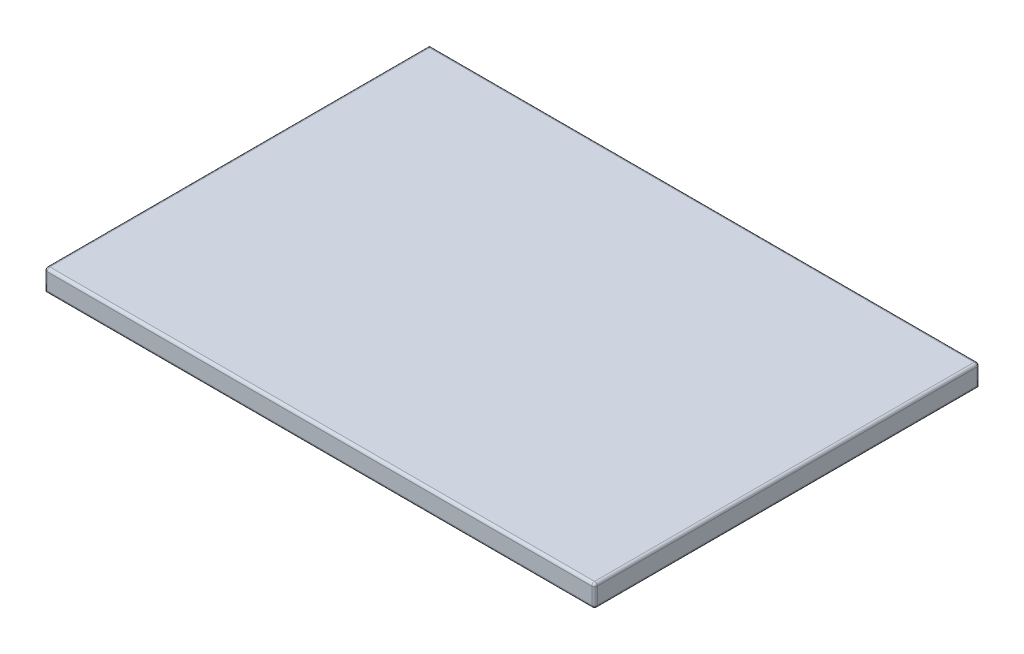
ISO-10303-21;
HEADER;
FILE_DESCRIPTION(('STEP AP214'),'2;1');
FILE_NAME('part.step','',(''),(''),'','','');
FILE_SCHEMA(('AUTOMOTIVE_DESIGN { 1 0 10303 214 1 1 1 1 }'));
ENDSEC;
DATA;
#1=APPLICATION_CONTEXT('core data for automotive mechanical design processes');
#2=APPLICATION_PROTOCOL_DEFINITION('international standard','automotive_design',2000,#1);
#3=PRODUCT_CONTEXT('',#1,'mechanical');
#4=PRODUCT('Part','Part','',(#3));
#5=PRODUCT_RELATED_PRODUCT_CATEGORY('part','',(#4));
#6=PRODUCT_DEFINITION_FORMATION('','',#4);
#7=PRODUCT_DEFINITION_CONTEXT('part definition',#1,'design');
#8=PRODUCT_DEFINITION('design','',#6,#7);
#9=PRODUCT_DEFINITION_SHAPE('','',#8);
#10=(LENGTH_UNIT() NAMED_UNIT(*) SI_UNIT(.MILLI.,.METRE.));
#11=(NAMED_UNIT(*) PLANE_ANGLE_UNIT() SI_UNIT($,.RADIAN.));
#12=(NAMED_UNIT(*) SI_UNIT($,.STERADIAN.) SOLID_ANGLE_UNIT());
#13=UNCERTAINTY_MEASURE_WITH_UNIT(LENGTH_MEASURE(1.E-05),#10,'distance_accuracy_value','');
#14=(GEOMETRIC_REPRESENTATION_CONTEXT(3) GLOBAL_UNCERTAINTY_ASSIGNED_CONTEXT((#13)) GLOBAL_UNIT_ASSIGNED_CONTEXT((#10,
#11,#12)) REPRESENTATION_CONTEXT('',''));
#15=CARTESIAN_POINT('',(0.,0.,0.));
#16=DIRECTION('',(0.,0.,1.));
#17=DIRECTION('',(1.,0.,0.));
#18=AXIS2_PLACEMENT_3D('',#15,#16,#17);
#19=CARTESIAN_POINT('',(0.,4.,0.));
#20=DIRECTION('',(1.,0.,0.));
#21=DIRECTION('',(0.,0.,-1.));
#22=AXIS2_PLACEMENT_3D('',#19,#20,#21);
#23=PLANE('',#22);
#24=DIRECTION('',(0.,0.,1.));
#25=VECTOR('',#24,1.);
#26=CARTESIAN_POINT('',(0.,3.5,0.));
#27=LINE('',#26,#25);
#28=CARTESIAN_POINT('',(0.,3.5,63.519379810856));
#29=VERTEX_POINT('',#28);
#30=CARTESIAN_POINT('',(0.,3.5,61.3346122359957));
#31=VERTEX_POINT('',#30);
#32=EDGE_CURVE('E309',#29,#31,#27,.F.);
#33=ORIENTED_EDGE('',*,*,#32,.T.);
#34=DIRECTION('',(0.,1.,0.));
#35=VECTOR('',#34,1.);
#36=CARTESIAN_POINT('',(0.,3.5,61.3346122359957));
#37=LINE('',#36,#35);
#38=CARTESIAN_POINT('',(0.,0.,61.3346122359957));
#39=VERTEX_POINT('',#38);
#40=EDGE_CURVE('E58',#39,#31,#37,.T.);
#41=ORIENTED_EDGE('',*,*,#40,.F.);
#42=DIRECTION('',(0.,0.,1.));
#43=VECTOR('',#42,1.);
#44=CARTESIAN_POINT('',(0.,0.,0.));
#45=LINE('',#44,#43);
#46=CARTESIAN_POINT('',(0.,0.,63.519379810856));
#47=VERTEX_POINT('',#46);
#48=EDGE_CURVE('E265',#39,#47,#45,.T.);
#49=ORIENTED_EDGE('',*,*,#48,.T.);
#50=DIRECTION('',(0.,-1.,0.));
#51=VECTOR('',#50,1.);
#52=CARTESIAN_POINT('',(0.,3.5,63.519379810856));
#53=LINE('',#52,#51);
#54=EDGE_CURVE('E206',#29,#47,#53,.T.);
#55=ORIENTED_EDGE('',*,*,#54,.F.);
#56=EDGE_LOOP('',(#33,#41,#49,#55));
#57=FACE_BOUND('',#56,.T.);
#58=ADVANCED_FACE('F33',(#57),#23,.F.);
#59=CARTESIAN_POINT('',(0.,0.,53.3911727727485));
#60=VERTEX_POINT('',#59);
#61=CARTESIAN_POINT('',(0.,0.,56.2588028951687));
#62=VERTEX_POINT('',#61);
#63=EDGE_CURVE('E264',#60,#62,#45,.T.);
#64=ORIENTED_EDGE('',*,*,#63,.T.);
#65=DIRECTION('',(0.,-1.,0.));
#66=VECTOR('',#65,1.);
#67=CARTESIAN_POINT('',(0.,3.5,56.2588028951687));
#68=LINE('',#67,#66);
#69=CARTESIAN_POINT('',(0.,3.5,56.2588028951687));
#70=VERTEX_POINT('',#69);
#71=EDGE_CURVE('E194',#70,#62,#68,.T.);
#72=ORIENTED_EDGE('',*,*,#71,.F.);
#73=CARTESIAN_POINT('',(0.,3.5,53.3911727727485));
#74=VERTEX_POINT('',#73);
#75=EDGE_CURVE('E374',#70,#74,#27,.F.);
#76=ORIENTED_EDGE('',*,*,#75,.T.);
#77=DIRECTION('',(0.,1.,0.));
#78=VECTOR('',#77,1.);
#79=CARTESIAN_POINT('',(0.,3.5,53.3911727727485));
#80=LINE('',#79,#78);
#81=EDGE_CURVE('E50',#60,#74,#80,.T.);
#82=ORIENTED_EDGE('',*,*,#81,.F.);
#83=EDGE_LOOP('',(#64,#72,#76,#82));
#84=FACE_BOUND('',#83,.T.);
#85=ADVANCED_FACE('F359',(#84),#23,.F.);
#86=CARTESIAN_POINT('',(0.,0.,0.));
#87=VERTEX_POINT('',#86);
#88=CARTESIAN_POINT('',(0.,0.,49.0578469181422));
#89=VERTEX_POINT('',#88);
#90=EDGE_CURVE('E260',#87,#89,#45,.T.);
#91=ORIENTED_EDGE('',*,*,#90,.T.);
#92=DIRECTION('',(0.,-1.,0.));
#93=VECTOR('',#92,1.);
#94=CARTESIAN_POINT('',(0.,3.5,49.0578469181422));
#95=LINE('',#94,#93);
#96=CARTESIAN_POINT('',(0.,3.5,49.0578469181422));
#97=VERTEX_POINT('',#96);
#98=EDGE_CURVE('E215',#97,#89,#95,.T.);
#99=ORIENTED_EDGE('',*,*,#98,.F.);
#100=CARTESIAN_POINT('',(0.,3.5,0.));
#101=VERTEX_POINT('',#100);
#102=EDGE_CURVE('E305',#97,#101,#27,.F.);
#103=ORIENTED_EDGE('',*,*,#102,.T.);
#104=DIRECTION('',(0.,-1.,0.));
#105=VECTOR('',#104,1.);
#106=CARTESIAN_POINT('',(0.,4.,0.));
#107=LINE('',#106,#105);
#108=EDGE_CURVE('E268',#101,#87,#107,.T.);
#109=ORIENTED_EDGE('',*,*,#108,.T.);
#110=EDGE_LOOP('',(#91,#99,#103,#109));
#111=FACE_BOUND('',#110,.T.);
#112=ADVANCED_FACE('F379',(#111),#23,.F.);
#113=CARTESIAN_POINT('',(0.,4.,70.));
#114=DIRECTION('',(0.,0.,-1.));
#115=DIRECTION('',(-1.,0.,0.));
#116=AXIS2_PLACEMENT_3D('',#113,#114,#115);
#117=PLANE('',#116);
#118=DIRECTION('',(1.,0.,0.));
#119=VECTOR('',#118,1.);
#120=CARTESIAN_POINT('',(0.,0.5,70.));
#121=LINE('',#120,#119);
#122=CARTESIAN_POINT('',(0.500000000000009,0.5,70.));
#123=VERTEX_POINT('',#122);
#124=CARTESIAN_POINT('',(99.5,0.5,70.));
#125=VERTEX_POINT('',#124);
#126=EDGE_CURVE('E274',#123,#125,#121,.T.);
#127=ORIENTED_EDGE('',*,*,#126,.T.);
#128=DIRECTION('',(0.,-1.,0.));
#129=VECTOR('',#128,1.);
#130=CARTESIAN_POINT('',(99.5,4.,70.));
#131=LINE('',#130,#129);
#132=CARTESIAN_POINT('',(99.5,3.5,70.));
#133=VERTEX_POINT('',#132);
#134=EDGE_CURVE('E277',#125,#133,#131,.F.);
#135=ORIENTED_EDGE('',*,*,#134,.T.);
#136=DIRECTION('',(1.,0.,0.));
#137=VECTOR('',#136,1.);
#138=CARTESIAN_POINT('',(0.,3.5,70.));
#139=LINE('',#138,#137);
#140=CARTESIAN_POINT('',(0.500000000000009,3.5,70.));
#141=VERTEX_POINT('',#140);
#142=EDGE_CURVE('E272',#133,#141,#139,.F.);
#143=ORIENTED_EDGE('',*,*,#142,.T.);
#144=DIRECTION('',(0.,-1.,0.));
#145=VECTOR('',#144,1.);
#146=CARTESIAN_POINT('',(0.500000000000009,4.,70.));
#147=LINE('',#146,#145);
#148=EDGE_CURVE('E270',#141,#123,#147,.T.);
#149=ORIENTED_EDGE('',*,*,#148,.T.);
#150=EDGE_LOOP('',(#127,#135,#143,#149));
#151=FACE_BOUND('',#150,.T.);
#152=ADVANCED_FACE('F427',(#151),#117,.F.);
#153=CARTESIAN_POINT('',(100.,4.,0.));
#154=DIRECTION('',(-1.,0.,0.));
#155=DIRECTION('',(0.,0.,1.));
#156=AXIS2_PLACEMENT_3D('',#153,#154,#155);
#157=PLANE('',#156);
#158=DIRECTION('',(0.,0.,-1.));
#159=VECTOR('',#158,1.);
#160=CARTESIAN_POINT('',(100.,0.5,0.));
#161=LINE('',#160,#159);
#162=CARTESIAN_POINT('',(100.,0.5,69.5));
#163=VERTEX_POINT('',#162);
#164=CARTESIAN_POINT('',(100.,0.5,0.5));
#165=VERTEX_POINT('',#164);
#166=EDGE_CURVE('E288',#163,#165,#161,.T.);
#167=ORIENTED_EDGE('',*,*,#166,.T.);
#168=DIRECTION('',(0.,-1.,0.));
#169=VECTOR('',#168,1.);
#170=CARTESIAN_POINT('',(100.,4.,0.5));
#171=LINE('',#170,#169);
#172=CARTESIAN_POINT('',(100.,3.5,0.5));
#173=VERTEX_POINT('',#172);
#174=EDGE_CURVE('E291',#165,#173,#171,.F.);
#175=ORIENTED_EDGE('',*,*,#174,.T.);
#176=DIRECTION('',(0.,0.,-1.));
#177=VECTOR('',#176,1.);
#178=CARTESIAN_POINT('',(100.,3.5,70.));
#179=LINE('',#178,#177);
#180=CARTESIAN_POINT('',(100.,3.5,69.5));
#181=VERTEX_POINT('',#180);
#182=EDGE_CURVE('E286',#173,#181,#179,.F.);
#183=ORIENTED_EDGE('',*,*,#182,.T.);
#184=DIRECTION('',(0.,-1.,0.));
#185=VECTOR('',#184,1.);
#186=CARTESIAN_POINT('',(100.,4.,69.5));
#187=LINE('',#186,#185);
#188=EDGE_CURVE('E284',#181,#163,#187,.T.);
#189=ORIENTED_EDGE('',*,*,#188,.T.);
#190=EDGE_LOOP('',(#167,#175,#183,#189));
#191=FACE_BOUND('',#190,.T.);
#192=ADVANCED_FACE('F401',(#191),#157,.F.);
#193=CARTESIAN_POINT('',(0.,4.,0.));
#194=DIRECTION('',(0.,0.,1.));
#195=DIRECTION('',(1.,0.,0.));
#196=AXIS2_PLACEMENT_3D('',#193,#194,#195);
#197=PLANE('',#196);
#198=ORIENTED_EDGE('',*,*,#108,.F.);
#199=DIRECTION('',(-1.,0.,0.));
#200=VECTOR('',#199,1.);
#201=CARTESIAN_POINT('',(100.,3.5,0.));
#202=LINE('',#201,#200);
#203=CARTESIAN_POINT('',(99.5,3.5,0.));
#204=VERTEX_POINT('',#203);
#205=EDGE_CURVE('E11',#101,#204,#202,.F.);
#206=ORIENTED_EDGE('',*,*,#205,.T.);
#207=DIRECTION('',(0.,-1.,0.));
#208=VECTOR('',#207,1.);
#209=CARTESIAN_POINT('',(99.5,4.,0.));
#210=LINE('',#209,#208);
#211=CARTESIAN_POINT('',(99.5,0.,0.));
#212=VERTEX_POINT('',#211);
#213=EDGE_CURVE('E42',#204,#212,#210,.T.);
#214=ORIENTED_EDGE('',*,*,#213,.T.);
#215=DIRECTION('',(-1.,0.,0.));
#216=VECTOR('',#215,1.);
#217=CARTESIAN_POINT('',(0.,0.,0.));
#218=LINE('',#217,#216);
#219=EDGE_CURVE('E263',#212,#87,#218,.T.);
#220=ORIENTED_EDGE('',*,*,#219,.T.);
#221=EDGE_LOOP('',(#198,#206,#214,#220));
#222=FACE_BOUND('',#221,.T.);
#223=ADVANCED_FACE('F382',(#222),#197,.F.);
#224=CARTESIAN_POINT('',(0.,4.,0.));
#225=DIRECTION('',(0.,1.,0.));
#226=DIRECTION('',(0.,0.,1.));
#227=AXIS2_PLACEMENT_3D('',#224,#225,#226);
#228=PLANE('',#227);
#229=DIRECTION('',(-1.,0.,0.));
#230=VECTOR('',#229,1.);
#231=CARTESIAN_POINT('',(0.,4.,0.5));
#232=LINE('',#231,#230);
#233=CARTESIAN_POINT('',(99.5,4.,0.5));
#234=VERTEX_POINT('',#233);
#235=CARTESIAN_POINT('',(0.5,4.,0.5));
#236=VERTEX_POINT('',#235);
#237=EDGE_CURVE('E293',#234,#236,#232,.T.);
#238=ORIENTED_EDGE('',*,*,#237,.T.);
#239=DIRECTION('',(0.,0.,1.));
#240=VECTOR('',#239,1.);
#241=CARTESIAN_POINT('',(0.500000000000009,4.,70.));
#242=LINE('',#241,#240);
#243=CARTESIAN_POINT('',(0.500000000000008,4.,69.5));
#244=VERTEX_POINT('',#243);
#245=EDGE_CURVE('E299',#236,#244,#242,.T.);
#246=ORIENTED_EDGE('',*,*,#245,.T.);
#247=DIRECTION('',(1.,0.,0.));
#248=VECTOR('',#247,1.);
#249=CARTESIAN_POINT('',(100.,4.,69.5));
#250=LINE('',#249,#248);
#251=CARTESIAN_POINT('',(99.5,4.,69.5));
#252=VERTEX_POINT('',#251);
#253=EDGE_CURVE('E297',#244,#252,#250,.T.);
#254=ORIENTED_EDGE('',*,*,#253,.T.);
#255=DIRECTION('',(0.,0.,-1.));
#256=VECTOR('',#255,1.);
#257=CARTESIAN_POINT('',(99.5,4.,0.));
#258=LINE('',#257,#256);
#259=EDGE_CURVE('E295',#252,#234,#258,.T.);
#260=ORIENTED_EDGE('',*,*,#259,.T.);
#261=EDGE_LOOP('',(#238,#246,#254,#260));
#262=FACE_BOUND('',#261,.T.);
#263=ADVANCED_FACE('F392',(#262),#228,.T.);
#264=CARTESIAN_POINT('',(0.,0.,0.));
#265=DIRECTION('',(0.,1.,0.));
#266=DIRECTION('',(0.,0.,1.));
#267=AXIS2_PLACEMENT_3D('',#264,#265,#266);
#268=PLANE('',#267);
#269=ORIENTED_EDGE('',*,*,#48,.F.);
#270=DIRECTION('',(-1.,0.,0.));
#271=VECTOR('',#270,1.);
#272=CARTESIAN_POINT('',(1.00000000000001,0.,61.3346122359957));
#273=LINE('',#272,#271);
#274=CARTESIAN_POINT('',(1.00000000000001,0.,61.3346122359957));
#275=VERTEX_POINT('',#274);
#276=EDGE_CURVE('E204',#275,#39,#273,.T.);
#277=ORIENTED_EDGE('',*,*,#276,.F.);
#278=DIRECTION('',(0.,0.,1.));
#279=VECTOR('',#278,1.);
#280=CARTESIAN_POINT('',(1.00000000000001,0.,61.3346122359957));
#281=LINE('',#280,#279);
#282=CARTESIAN_POINT('',(1.00000000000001,0.,56.2588028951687));
#283=VERTEX_POINT('',#282);
#284=EDGE_CURVE('E181',#283,#275,#281,.T.);
#285=ORIENTED_EDGE('',*,*,#284,.F.);
#286=DIRECTION('',(-1.,0.,0.));
#287=VECTOR('',#286,1.);
#288=CARTESIAN_POINT('',(1.00000000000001,0.,56.2588028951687));
#289=LINE('',#288,#287);
#290=EDGE_CURVE('E207',#283,#62,#289,.T.);
#291=ORIENTED_EDGE('',*,*,#290,.T.);
#292=ORIENTED_EDGE('',*,*,#63,.F.);
#293=DIRECTION('',(-1.,0.,0.));
#294=VECTOR('',#293,1.);
#295=CARTESIAN_POINT('',(1.00000000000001,0.,53.3911727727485));
#296=LINE('',#295,#294);
#297=CARTESIAN_POINT('',(1.00000000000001,0.,53.3911727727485));
#298=VERTEX_POINT('',#297);
#299=EDGE_CURVE('E202',#298,#60,#296,.T.);
#300=ORIENTED_EDGE('',*,*,#299,.F.);
#301=DIRECTION('',(0.,0.,1.));
#302=VECTOR('',#301,1.);
#303=CARTESIAN_POINT('',(1.00000000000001,0.,53.3911727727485));
#304=LINE('',#303,#302);
#305=CARTESIAN_POINT('',(1.00000000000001,0.,49.0578469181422));
#306=VERTEX_POINT('',#305);
#307=EDGE_CURVE('E221',#306,#298,#304,.T.);
#308=ORIENTED_EDGE('',*,*,#307,.F.);
#309=DIRECTION('',(-1.,0.,0.));
#310=VECTOR('',#309,1.);
#311=CARTESIAN_POINT('',(1.00000000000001,0.,49.0578469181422));
#312=LINE('',#311,#310);
#313=EDGE_CURVE('E231',#306,#89,#312,.T.);
#314=ORIENTED_EDGE('',*,*,#313,.T.);
#315=ORIENTED_EDGE('',*,*,#90,.F.);
#316=ORIENTED_EDGE('',*,*,#219,.F.);
#317=DIRECTION('',(0.,0.,-1.));
#318=VECTOR('',#317,1.);
#319=CARTESIAN_POINT('',(99.5,0.,0.));
#320=LINE('',#319,#318);
#321=CARTESIAN_POINT('',(99.5,0.,69.5));
#322=VERTEX_POINT('',#321);
#323=EDGE_CURVE('E279',#212,#322,#320,.F.);
#324=ORIENTED_EDGE('',*,*,#323,.T.);
#325=DIRECTION('',(1.,0.,0.));
#326=VECTOR('',#325,1.);
#327=CARTESIAN_POINT('',(0.,0.,69.5));
#328=LINE('',#327,#326);
#329=CARTESIAN_POINT('',(1.00000000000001,0.,69.5));
#330=VERTEX_POINT('',#329);
#331=EDGE_CURVE('E281',#322,#330,#328,.F.);
#332=ORIENTED_EDGE('',*,*,#331,.T.);
#333=DIRECTION('',(0.,0.,1.));
#334=VECTOR('',#333,1.);
#335=CARTESIAN_POINT('',(1.00000000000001,0.,69.5));
#336=LINE('',#335,#334);
#337=CARTESIAN_POINT('',(1.00000000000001,0.,63.519379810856));
#338=VERTEX_POINT('',#337);
#339=EDGE_CURVE('E246',#338,#330,#336,.T.);
#340=ORIENTED_EDGE('',*,*,#339,.F.);
#341=DIRECTION('',(-1.,0.,0.));
#342=VECTOR('',#341,1.);
#343=CARTESIAN_POINT('',(1.00000000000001,0.,63.519379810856));
#344=LINE('',#343,#342);
#345=EDGE_CURVE('E254',#338,#47,#344,.T.);
#346=ORIENTED_EDGE('',*,*,#345,.T.);
#347=EDGE_LOOP('',(#269,#277,#285,#291,#292,#300,#308,#314,#315,#316,#324,#332,#340,#346));
#348=FACE_BOUND('',#347,.T.);
#349=ADVANCED_FACE('F364',(#348),#268,.F.);
#350=CARTESIAN_POINT('',(0.,3.5,0.5));
#351=DIRECTION('',(1.,0.,0.));
#352=DIRECTION('',(0.,0.,-1.));
#353=AXIS2_PLACEMENT_3D('',#350,#351,#352);
#354=CYLINDRICAL_SURFACE('',#353,0.5);
#355=CARTESIAN_POINT('',(0.5,3.5,0.5));
#356=DIRECTION('',(0.707106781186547,0.,-0.707106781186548));
#357=DIRECTION('',(0.707106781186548,0.,0.707106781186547));
#358=AXIS2_PLACEMENT_3D('',#355,#356,#357);
#359=ELLIPSE('',#358,0.707106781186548,0.5);
#360=EDGE_CURVE('E343',#236,#101,#359,.F.);
#361=ORIENTED_EDGE('',*,*,#360,.F.);
#362=ORIENTED_EDGE('',*,*,#237,.F.);
#363=CARTESIAN_POINT('',(99.5,3.5,0.5));
#364=DIRECTION('',(1.,0.,0.));
#365=DIRECTION('',(0.,0.,-1.));
#366=AXIS2_PLACEMENT_3D('',#363,#364,#365);
#367=CIRCLE('',#366,0.5);
#368=EDGE_CURVE('E345',#204,#234,#367,.T.);
#369=ORIENTED_EDGE('',*,*,#368,.F.);
#370=ORIENTED_EDGE('',*,*,#205,.F.);
#371=EDGE_LOOP('',(#361,#362,#369,#370));
#372=FACE_BOUND('',#371,.T.);
#373=ADVANCED_FACE('F35',(#372),#354,.T.);
#374=CARTESIAN_POINT('',(99.5,3.5,0.));
#375=DIRECTION('',(0.,0.,1.));
#376=DIRECTION('',(1.,0.,0.));
#377=AXIS2_PLACEMENT_3D('',#374,#375,#376);
#378=CYLINDRICAL_SURFACE('',#377,0.5);
#379=CARTESIAN_POINT('',(99.5,3.5,0.5));
#380=DIRECTION('',(0.,0.,-1.));
#381=DIRECTION('',(-1.,0.,0.));
#382=AXIS2_PLACEMENT_3D('',#379,#380,#381);
#383=CIRCLE('',#382,0.5);
#384=EDGE_CURVE('E37',#234,#173,#383,.T.);
#385=ORIENTED_EDGE('',*,*,#384,.F.);
#386=ORIENTED_EDGE('',*,*,#259,.F.);
#387=CARTESIAN_POINT('',(99.5,3.5,69.5));
#388=DIRECTION('',(0.,0.,1.));
#389=DIRECTION('',(1.,0.,0.));
#390=AXIS2_PLACEMENT_3D('',#387,#388,#389);
#391=CIRCLE('',#390,0.5);
#392=EDGE_CURVE('E337',#181,#252,#391,.T.);
#393=ORIENTED_EDGE('',*,*,#392,.F.);
#394=ORIENTED_EDGE('',*,*,#182,.F.);
#395=EDGE_LOOP('',(#385,#386,#393,#394));
#396=FACE_BOUND('',#395,.T.);
#397=ADVANCED_FACE('F396',(#396),#378,.T.);
#398=CARTESIAN_POINT('',(99.5,3.5,0.5));
#399=DIRECTION('',(0.,0.,1.));
#400=DIRECTION('',(1.,0.,0.));
#401=AXIS2_PLACEMENT_3D('',#398,#399,#400);
#402=SPHERICAL_SURFACE('',#401,0.5);
#403=ORIENTED_EDGE('',*,*,#368,.T.);
#404=ORIENTED_EDGE('',*,*,#384,.T.);
#405=CARTESIAN_POINT('',(99.5,3.5,0.5));
#406=DIRECTION('',(0.,1.,0.));
#407=DIRECTION('',(0.,0.,1.));
#408=AXIS2_PLACEMENT_3D('',#405,#406,#407);
#409=CIRCLE('',#408,0.5);
#410=EDGE_CURVE('E334',#204,#173,#409,.F.);
#411=ORIENTED_EDGE('',*,*,#410,.F.);
#412=EDGE_LOOP('',(#403,#404,#411));
#413=FACE_BOUND('',#412,.T.);
#414=ADVANCED_FACE('F410',(#413),#402,.T.);
#415=CARTESIAN_POINT('',(0.5,3.5,0.));
#416=DIRECTION('',(0.,0.,-1.));
#417=DIRECTION('',(-1.,0.,0.));
#418=AXIS2_PLACEMENT_3D('',#415,#416,#417);
#419=CYLINDRICAL_SURFACE('',#418,0.5);
#420=ORIENTED_EDGE('',*,*,#360,.T.);
#421=ORIENTED_EDGE('',*,*,#102,.F.);
#422=DIRECTION('',(0.,0.,-1.));
#423=VECTOR('',#422,1.);
#424=CARTESIAN_POINT('',(0.,3.5,53.3911727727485));
#425=LINE('',#424,#423);
#426=EDGE_CURVE('E226',#74,#97,#425,.T.);
#427=ORIENTED_EDGE('',*,*,#426,.F.);
#428=ORIENTED_EDGE('',*,*,#75,.F.);
#429=DIRECTION('',(0.,0.,-1.));
#430=VECTOR('',#429,1.);
#431=CARTESIAN_POINT('',(0.,3.5,61.3346122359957));
#432=LINE('',#431,#430);
#433=EDGE_CURVE('E196',#31,#70,#432,.T.);
#434=ORIENTED_EDGE('',*,*,#433,.F.);
#435=ORIENTED_EDGE('',*,*,#32,.F.);
#436=CARTESIAN_POINT('',(0.,3.5,69.5));
#437=VERTEX_POINT('',#436);
#438=EDGE_CURVE('E306',#437,#29,#27,.F.);
#439=ORIENTED_EDGE('',*,*,#438,.F.);
#440=CARTESIAN_POINT('',(0.500000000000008,3.5,69.5));
#441=DIRECTION('',(0.,0.,1.));
#442=DIRECTION('',(1.,0.,0.));
#443=AXIS2_PLACEMENT_3D('',#440,#441,#442);
#444=CIRCLE('',#443,0.5);
#445=EDGE_CURVE('E331',#244,#437,#444,.T.);
#446=ORIENTED_EDGE('',*,*,#445,.F.);
#447=ORIENTED_EDGE('',*,*,#245,.F.);
#448=EDGE_LOOP('',(#420,#421,#427,#428,#434,#435,#439,#446,#447));
#449=FACE_BOUND('',#448,.T.);
#450=ADVANCED_FACE('F371',(#449),#419,.T.);
#451=CARTESIAN_POINT('',(0.,3.5,69.5));
#452=DIRECTION('',(-1.,0.,0.));
#453=DIRECTION('',(0.,0.,1.));
#454=AXIS2_PLACEMENT_3D('',#451,#452,#453);
#455=CYLINDRICAL_SURFACE('',#454,0.5);
#456=CARTESIAN_POINT('',(99.5,3.5,69.5));
#457=DIRECTION('',(1.,0.,0.));
#458=DIRECTION('',(0.,0.,-1.));
#459=AXIS2_PLACEMENT_3D('',#456,#457,#458);
#460=CIRCLE('',#459,0.5);
#461=EDGE_CURVE('E340',#252,#133,#460,.T.);
#462=ORIENTED_EDGE('',*,*,#461,.F.);
#463=ORIENTED_EDGE('',*,*,#253,.F.);
#464=CARTESIAN_POINT('',(0.500000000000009,3.5,69.5));
#465=DIRECTION('',(-1.,0.,0.));
#466=DIRECTION('',(0.,-1.,0.));
#467=AXIS2_PLACEMENT_3D('',#464,#465,#466);
#468=CIRCLE('',#467,0.5);
#469=EDGE_CURVE('E329',#141,#244,#468,.T.);
#470=ORIENTED_EDGE('',*,*,#469,.F.);
#471=ORIENTED_EDGE('',*,*,#142,.F.);
#472=EDGE_LOOP('',(#462,#463,#470,#471));
#473=FACE_BOUND('',#472,.T.);
#474=ADVANCED_FACE('F417',(#473),#455,.T.);
#475=CARTESIAN_POINT('',(99.5,3.5,69.5));
#476=DIRECTION('',(0.,0.,1.));
#477=DIRECTION('',(1.,0.,0.));
#478=AXIS2_PLACEMENT_3D('',#475,#476,#477);
#479=SPHERICAL_SURFACE('',#478,0.5);
#480=ORIENTED_EDGE('',*,*,#392,.T.);
#481=ORIENTED_EDGE('',*,*,#461,.T.);
#482=CARTESIAN_POINT('',(99.5,3.5,69.5));
#483=DIRECTION('',(0.,1.,0.));
#484=DIRECTION('',(0.,0.,1.));
#485=AXIS2_PLACEMENT_3D('',#482,#483,#484);
#486=CIRCLE('',#485,0.5);
#487=EDGE_CURVE('E326',#181,#133,#486,.F.);
#488=ORIENTED_EDGE('',*,*,#487,.F.);
#489=EDGE_LOOP('',(#480,#481,#488));
#490=FACE_BOUND('',#489,.T.);
#491=ADVANCED_FACE('F581',(#490),#479,.T.);
#492=CARTESIAN_POINT('',(99.5,4.,0.5));
#493=DIRECTION('',(0.,-1.,0.));
#494=DIRECTION('',(0.,0.,-1.));
#495=AXIS2_PLACEMENT_3D('',#492,#493,#494);
#496=CYLINDRICAL_SURFACE('',#495,0.5);
#497=ORIENTED_EDGE('',*,*,#410,.T.);
#498=ORIENTED_EDGE('',*,*,#174,.F.);
#499=CARTESIAN_POINT('',(99.5,0.5,0.5));
#500=DIRECTION('',(0.,-0.707106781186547,0.707106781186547));
#501=DIRECTION('',(0.,-0.707106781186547,-0.707106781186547));
#502=AXIS2_PLACEMENT_3D('',#499,#500,#501);
#503=ELLIPSE('',#502,0.707106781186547,0.5);
#504=EDGE_CURVE('E324',#212,#165,#503,.T.);
#505=ORIENTED_EDGE('',*,*,#504,.F.);
#506=ORIENTED_EDGE('',*,*,#213,.F.);
#507=EDGE_LOOP('',(#497,#498,#505,#506));
#508=FACE_BOUND('',#507,.T.);
#509=ADVANCED_FACE('F407',(#508),#496,.T.);
#510=CARTESIAN_POINT('',(0.500000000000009,3.5,69.5));
#511=DIRECTION('',(0.,0.,1.));
#512=DIRECTION('',(1.,0.,0.));
#513=AXIS2_PLACEMENT_3D('',#510,#511,#512);
#514=SPHERICAL_SURFACE('',#513,0.5);
#515=ORIENTED_EDGE('',*,*,#469,.T.);
#516=ORIENTED_EDGE('',*,*,#445,.T.);
#517=CARTESIAN_POINT('',(0.500000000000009,3.5,69.5));
#518=DIRECTION('',(0.,1.,0.));
#519=DIRECTION('',(0.,0.,1.));
#520=AXIS2_PLACEMENT_3D('',#517,#518,#519);
#521=CIRCLE('',#520,0.5);
#522=EDGE_CURVE('E321',#141,#437,#521,.F.);
#523=ORIENTED_EDGE('',*,*,#522,.F.);
#524=EDGE_LOOP('',(#515,#516,#523));
#525=FACE_BOUND('',#524,.T.);
#526=ADVANCED_FACE('F566',(#525),#514,.T.);
#527=CARTESIAN_POINT('',(99.5,4.,69.5));
#528=DIRECTION('',(0.,-1.,0.));
#529=DIRECTION('',(0.,0.,-1.));
#530=AXIS2_PLACEMENT_3D('',#527,#528,#529);
#531=CYLINDRICAL_SURFACE('',#530,0.5);
#532=ORIENTED_EDGE('',*,*,#487,.T.);
#533=ORIENTED_EDGE('',*,*,#134,.F.);
#534=CARTESIAN_POINT('',(99.5,0.5,69.5));
#535=DIRECTION('',(0.,-1.,0.));
#536=DIRECTION('',(0.,0.,-1.));
#537=AXIS2_PLACEMENT_3D('',#534,#535,#536);
#538=CIRCLE('',#537,0.5);
#539=EDGE_CURVE('E318',#163,#125,#538,.T.);
#540=ORIENTED_EDGE('',*,*,#539,.F.);
#541=ORIENTED_EDGE('',*,*,#188,.F.);
#542=EDGE_LOOP('',(#532,#533,#540,#541));
#543=FACE_BOUND('',#542,.T.);
#544=ADVANCED_FACE('F558',(#543),#531,.T.);
#545=CARTESIAN_POINT('',(99.5,0.5,0.));
#546=DIRECTION('',(0.,0.,-1.));
#547=DIRECTION('',(-1.,0.,0.));
#548=AXIS2_PLACEMENT_3D('',#545,#546,#547);
#549=CYLINDRICAL_SURFACE('',#548,0.5);
#550=ORIENTED_EDGE('',*,*,#504,.T.);
#551=ORIENTED_EDGE('',*,*,#166,.F.);
#552=CARTESIAN_POINT('',(99.5,0.5,69.5));
#553=DIRECTION('',(0.,0.,1.));
#554=DIRECTION('',(1.,0.,0.));
#555=AXIS2_PLACEMENT_3D('',#552,#553,#554);
#556=CIRCLE('',#555,0.5);
#557=EDGE_CURVE('E315',#322,#163,#556,.T.);
#558=ORIENTED_EDGE('',*,*,#557,.F.);
#559=ORIENTED_EDGE('',*,*,#323,.F.);
#560=EDGE_LOOP('',(#550,#551,#558,#559));
#561=FACE_BOUND('',#560,.T.);
#562=ADVANCED_FACE('F550',(#561),#549,.T.);
#563=CARTESIAN_POINT('',(0.500000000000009,4.,69.5));
#564=DIRECTION('',(0.,-1.,0.));
#565=DIRECTION('',(0.,0.,-1.));
#566=AXIS2_PLACEMENT_3D('',#563,#564,#565);
#567=CYLINDRICAL_SURFACE('',#566,0.5);
#568=ORIENTED_EDGE('',*,*,#522,.T.);
#569=DIRECTION('',(0.,-1.,0.));
#570=VECTOR('',#569,1.);
#571=CARTESIAN_POINT('',(0.,4.,69.5));
#572=LINE('',#571,#570);
#573=CARTESIAN_POINT('',(0.,0.,69.5));
#574=VERTEX_POINT('',#573);
#575=EDGE_CURVE('E302',#574,#437,#572,.F.);
#576=ORIENTED_EDGE('',*,*,#575,.F.);
#577=CARTESIAN_POINT('',(0.500000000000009,0.5,69.5));
#578=DIRECTION('',(0.707106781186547,-0.707106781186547,0.));
#579=DIRECTION('',(-0.707106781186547,-0.707106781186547,0.));
#580=AXIS2_PLACEMENT_3D('',#577,#578,#579);
#581=ELLIPSE('',#580,0.707106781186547,0.5);
#582=EDGE_CURVE('E312',#123,#574,#581,.T.);
#583=ORIENTED_EDGE('',*,*,#582,.F.);
#584=ORIENTED_EDGE('',*,*,#148,.F.);
#585=EDGE_LOOP('',(#568,#576,#583,#584));
#586=FACE_BOUND('',#585,.T.);
#587=ADVANCED_FACE('F542',(#586),#567,.T.);
#588=CARTESIAN_POINT('',(99.5,0.5,69.5));
#589=DIRECTION('',(0.,0.,1.));
#590=DIRECTION('',(1.,0.,0.));
#591=AXIS2_PLACEMENT_3D('',#588,#589,#590);
#592=SPHERICAL_SURFACE('',#591,0.5);
#593=ORIENTED_EDGE('',*,*,#557,.T.);
#594=ORIENTED_EDGE('',*,*,#539,.T.);
#595=CARTESIAN_POINT('',(99.5,0.5,69.5));
#596=DIRECTION('',(1.,0.,0.));
#597=DIRECTION('',(0.,0.,-1.));
#598=AXIS2_PLACEMENT_3D('',#595,#596,#597);
#599=CIRCLE('',#598,0.5);
#600=EDGE_CURVE('E253',#322,#125,#599,.F.);
#601=ORIENTED_EDGE('',*,*,#600,.F.);
#602=EDGE_LOOP('',(#593,#594,#601));
#603=FACE_BOUND('',#602,.T.);
#604=ADVANCED_FACE('F534',(#603),#592,.T.);
#605=CARTESIAN_POINT('',(0.,0.5,69.5));
#606=DIRECTION('',(1.,0.,0.));
#607=DIRECTION('',(0.,0.,-1.));
#608=AXIS2_PLACEMENT_3D('',#605,#606,#607);
#609=CYLINDRICAL_SURFACE('',#608,0.5);
#610=ORIENTED_EDGE('',*,*,#582,.T.);
#611=DIRECTION('',(-1.,0.,0.));
#612=VECTOR('',#611,1.);
#613=CARTESIAN_POINT('',(1.00000000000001,0.,69.5));
#614=LINE('',#613,#612);
#615=EDGE_CURVE('E251',#330,#574,#614,.T.);
#616=ORIENTED_EDGE('',*,*,#615,.F.);
#617=ORIENTED_EDGE('',*,*,#331,.F.);
#618=ORIENTED_EDGE('',*,*,#600,.T.);
#619=ORIENTED_EDGE('',*,*,#126,.F.);
#620=EDGE_LOOP('',(#610,#616,#617,#618,#619));
#621=FACE_BOUND('',#620,.T.);
#622=ADVANCED_FACE('F447',(#621),#609,.T.);
#623=CARTESIAN_POINT('',(1.00000000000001,3.5,69.5));
#624=DIRECTION('',(0.,0.,1.));
#625=DIRECTION('',(1.,0.,0.));
#626=AXIS2_PLACEMENT_3D('',#623,#624,#625);
#627=PLANE('',#626);
#628=ORIENTED_EDGE('',*,*,#575,.T.);
#629=DIRECTION('',(-1.,0.,0.));
#630=VECTOR('',#629,1.);
#631=CARTESIAN_POINT('',(1.00000000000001,3.5,69.5));
#632=LINE('',#631,#630);
#633=CARTESIAN_POINT('',(1.00000000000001,3.5,69.5));
#634=VERTEX_POINT('',#633);
#635=EDGE_CURVE('E248',#634,#437,#632,.T.);
#636=ORIENTED_EDGE('',*,*,#635,.F.);
#637=DIRECTION('',(0.,1.,0.));
#638=VECTOR('',#637,1.);
#639=CARTESIAN_POINT('',(1.00000000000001,3.5,69.5));
#640=LINE('',#639,#638);
#641=EDGE_CURVE('E237',#330,#634,#640,.T.);
#642=ORIENTED_EDGE('',*,*,#641,.F.);
#643=ORIENTED_EDGE('',*,*,#615,.T.);
#644=EDGE_LOOP('',(#628,#636,#642,#643));
#645=FACE_BOUND('',#644,.T.);
#646=ADVANCED_FACE('F443',(#645),#627,.F.);
#647=CARTESIAN_POINT('',(1.00000000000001,3.5,63.519379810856));
#648=DIRECTION('',(0.,0.,-1.));
#649=DIRECTION('',(-1.,0.,0.));
#650=AXIS2_PLACEMENT_3D('',#647,#648,#649);
#651=PLANE('',#650);
#652=ORIENTED_EDGE('',*,*,#54,.T.);
#653=ORIENTED_EDGE('',*,*,#345,.F.);
#654=DIRECTION('',(0.,-1.,0.));
#655=VECTOR('',#654,1.);
#656=CARTESIAN_POINT('',(1.00000000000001,3.5,63.519379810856));
#657=LINE('',#656,#655);
#658=CARTESIAN_POINT('',(1.00000000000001,3.5,63.519379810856));
#659=VERTEX_POINT('',#658);
#660=EDGE_CURVE('E243',#659,#338,#657,.T.);
#661=ORIENTED_EDGE('',*,*,#660,.F.);
#662=DIRECTION('',(-1.,0.,0.));
#663=VECTOR('',#662,1.);
#664=CARTESIAN_POINT('',(1.00000000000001,3.5,63.519379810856));
#665=LINE('',#664,#663);
#666=EDGE_CURVE('E257',#659,#29,#665,.T.);
#667=ORIENTED_EDGE('',*,*,#666,.T.);
#668=EDGE_LOOP('',(#652,#653,#661,#667));
#669=FACE_BOUND('',#668,.T.);
#670=ADVANCED_FACE('F446',(#669),#651,.F.);
#671=CARTESIAN_POINT('',(1.00000000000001,3.5,69.5));
#672=DIRECTION('',(0.,1.,0.));
#673=DIRECTION('',(0.,0.,1.));
#674=AXIS2_PLACEMENT_3D('',#671,#672,#673);
#675=PLANE('',#674);
#676=ORIENTED_EDGE('',*,*,#438,.T.);
#677=ORIENTED_EDGE('',*,*,#666,.F.);
#678=DIRECTION('',(0.,0.,-1.));
#679=VECTOR('',#678,1.);
#680=CARTESIAN_POINT('',(1.00000000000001,3.5,69.5));
#681=LINE('',#680,#679);
#682=EDGE_CURVE('E240',#634,#659,#681,.T.);
#683=ORIENTED_EDGE('',*,*,#682,.F.);
#684=ORIENTED_EDGE('',*,*,#635,.T.);
#685=EDGE_LOOP('',(#676,#677,#683,#684));
#686=FACE_BOUND('',#685,.T.);
#687=ADVANCED_FACE('F449',(#686),#675,.F.);
#688=CARTESIAN_POINT('',(1.,0.,0.));
#689=DIRECTION('',(1.,0.,0.));
#690=DIRECTION('',(0.,0.,-1.));
#691=AXIS2_PLACEMENT_3D('',#688,#689,#690);
#692=PLANE('',#691);
#693=ORIENTED_EDGE('',*,*,#641,.T.);
#694=ORIENTED_EDGE('',*,*,#682,.T.);
#695=ORIENTED_EDGE('',*,*,#660,.T.);
#696=ORIENTED_EDGE('',*,*,#339,.T.);
#697=EDGE_LOOP('',(#693,#694,#695,#696));
#698=FACE_BOUND('',#697,.T.);
#699=ADVANCED_FACE('F452',(#698),#692,.F.);
#700=CARTESIAN_POINT('',(1.00000000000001,3.5,53.3911727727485));
#701=DIRECTION('',(0.,0.,1.));
#702=DIRECTION('',(1.,0.,0.));
#703=AXIS2_PLACEMENT_3D('',#700,#701,#702);
#704=PLANE('',#703);
#705=ORIENTED_EDGE('',*,*,#81,.T.);
#706=DIRECTION('',(-1.,0.,0.));
#707=VECTOR('',#706,1.);
#708=CARTESIAN_POINT('',(1.00000000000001,3.5,53.3911727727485));
#709=LINE('',#708,#707);
#710=CARTESIAN_POINT('',(1.00000000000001,3.5,53.3911727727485));
#711=VERTEX_POINT('',#710);
#712=EDGE_CURVE('E224',#711,#74,#709,.T.);
#713=ORIENTED_EDGE('',*,*,#712,.F.);
#714=DIRECTION('',(0.,1.,0.));
#715=VECTOR('',#714,1.);
#716=CARTESIAN_POINT('',(1.00000000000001,3.5,53.3911727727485));
#717=LINE('',#716,#715);
#718=EDGE_CURVE('E211',#298,#711,#717,.T.);
#719=ORIENTED_EDGE('',*,*,#718,.F.);
#720=ORIENTED_EDGE('',*,*,#299,.T.);
#721=EDGE_LOOP('',(#705,#713,#719,#720));
#722=FACE_BOUND('',#721,.T.);
#723=ADVANCED_FACE('F459',(#722),#704,.F.);
#724=CARTESIAN_POINT('',(1.00000000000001,3.5,49.0578469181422));
#725=DIRECTION('',(0.,0.,-1.));
#726=DIRECTION('',(-1.,0.,0.));
#727=AXIS2_PLACEMENT_3D('',#724,#725,#726);
#728=PLANE('',#727);
#729=ORIENTED_EDGE('',*,*,#98,.T.);
#730=ORIENTED_EDGE('',*,*,#313,.F.);
#731=DIRECTION('',(0.,-1.,0.));
#732=VECTOR('',#731,1.);
#733=CARTESIAN_POINT('',(1.00000000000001,3.5,49.0578469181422));
#734=LINE('',#733,#732);
#735=CARTESIAN_POINT('',(1.00000000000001,3.5,49.0578469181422));
#736=VERTEX_POINT('',#735);
#737=EDGE_CURVE('E218',#736,#306,#734,.T.);
#738=ORIENTED_EDGE('',*,*,#737,.F.);
#739=DIRECTION('',(-1.,0.,0.));
#740=VECTOR('',#739,1.);
#741=CARTESIAN_POINT('',(1.00000000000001,3.5,49.0578469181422));
#742=LINE('',#741,#740);
#743=EDGE_CURVE('E234',#736,#97,#742,.T.);
#744=ORIENTED_EDGE('',*,*,#743,.T.);
#745=EDGE_LOOP('',(#729,#730,#738,#744));
#746=FACE_BOUND('',#745,.T.);
#747=ADVANCED_FACE('F463',(#746),#728,.F.);
#748=CARTESIAN_POINT('',(1.00000000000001,3.5,53.3911727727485));
#749=DIRECTION('',(0.,1.,0.));
#750=DIRECTION('',(0.,0.,1.));
#751=AXIS2_PLACEMENT_3D('',#748,#749,#750);
#752=PLANE('',#751);
#753=ORIENTED_EDGE('',*,*,#426,.T.);
#754=ORIENTED_EDGE('',*,*,#743,.F.);
#755=DIRECTION('',(0.,0.,-1.));
#756=VECTOR('',#755,1.);
#757=CARTESIAN_POINT('',(1.00000000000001,3.5,53.3911727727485));
#758=LINE('',#757,#756);
#759=EDGE_CURVE('E214',#711,#736,#758,.T.);
#760=ORIENTED_EDGE('',*,*,#759,.F.);
#761=ORIENTED_EDGE('',*,*,#712,.T.);
#762=EDGE_LOOP('',(#753,#754,#760,#761));
#763=FACE_BOUND('',#762,.T.);
#764=ADVANCED_FACE('F464',(#763),#752,.F.);
#765=CARTESIAN_POINT('',(1.,0.,0.));
#766=DIRECTION('',(1.,0.,0.));
#767=DIRECTION('',(0.,0.,-1.));
#768=AXIS2_PLACEMENT_3D('',#765,#766,#767);
#769=PLANE('',#768);
#770=ORIENTED_EDGE('',*,*,#718,.T.);
#771=ORIENTED_EDGE('',*,*,#759,.T.);
#772=ORIENTED_EDGE('',*,*,#737,.T.);
#773=ORIENTED_EDGE('',*,*,#307,.T.);
#774=EDGE_LOOP('',(#770,#771,#772,#773));
#775=FACE_BOUND('',#774,.T.);
#776=ADVANCED_FACE('F467',(#775),#769,.F.);
#777=CARTESIAN_POINT('',(1.00000000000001,3.5,61.3346122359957));
#778=DIRECTION('',(0.,0.,1.));
#779=DIRECTION('',(1.,0.,0.));
#780=AXIS2_PLACEMENT_3D('',#777,#778,#779);
#781=PLANE('',#780);
#782=ORIENTED_EDGE('',*,*,#40,.T.);
#783=DIRECTION('',(-1.,0.,0.));
#784=VECTOR('',#783,1.);
#785=CARTESIAN_POINT('',(1.00000000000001,3.5,61.3346122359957));
#786=LINE('',#785,#784);
#787=CARTESIAN_POINT('',(1.00000000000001,3.5,61.3346122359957));
#788=VERTEX_POINT('',#787);
#789=EDGE_CURVE('E171',#788,#31,#786,.T.);
#790=ORIENTED_EDGE('',*,*,#789,.F.);
#791=DIRECTION('',(0.,1.,0.));
#792=VECTOR('',#791,1.);
#793=CARTESIAN_POINT('',(1.00000000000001,3.5,61.3346122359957));
#794=LINE('',#793,#792);
#795=EDGE_CURVE('E175',#275,#788,#794,.T.);
#796=ORIENTED_EDGE('',*,*,#795,.F.);
#797=ORIENTED_EDGE('',*,*,#276,.T.);
#798=EDGE_LOOP('',(#782,#790,#796,#797));
#799=FACE_BOUND('',#798,.T.);
#800=ADVANCED_FACE('F173',(#799),#781,.F.);
#801=CARTESIAN_POINT('',(1.00000000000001,3.5,56.2588028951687));
#802=DIRECTION('',(0.,0.,-1.));
#803=DIRECTION('',(-1.,0.,0.));
#804=AXIS2_PLACEMENT_3D('',#801,#802,#803);
#805=PLANE('',#804);
#806=ORIENTED_EDGE('',*,*,#71,.T.);
#807=ORIENTED_EDGE('',*,*,#290,.F.);
#808=DIRECTION('',(0.,-1.,0.));
#809=VECTOR('',#808,1.);
#810=CARTESIAN_POINT('',(1.00000000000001,3.5,56.2588028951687));
#811=LINE('',#810,#809);
#812=CARTESIAN_POINT('',(1.00000000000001,3.5,56.2588028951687));
#813=VERTEX_POINT('',#812);
#814=EDGE_CURVE('E189',#813,#283,#811,.T.);
#815=ORIENTED_EDGE('',*,*,#814,.F.);
#816=DIRECTION('',(-1.,0.,0.));
#817=VECTOR('',#816,1.);
#818=CARTESIAN_POINT('',(1.00000000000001,3.5,56.2588028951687));
#819=LINE('',#818,#817);
#820=EDGE_CURVE('E180',#813,#70,#819,.T.);
#821=ORIENTED_EDGE('',*,*,#820,.T.);
#822=EDGE_LOOP('',(#806,#807,#815,#821));
#823=FACE_BOUND('',#822,.T.);
#824=ADVANCED_FACE('F367',(#823),#805,.F.);
#825=CARTESIAN_POINT('',(1.00000000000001,3.5,61.3346122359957));
#826=DIRECTION('',(0.,1.,0.));
#827=DIRECTION('',(0.,0.,1.));
#828=AXIS2_PLACEMENT_3D('',#825,#826,#827);
#829=PLANE('',#828);
#830=ORIENTED_EDGE('',*,*,#433,.T.);
#831=ORIENTED_EDGE('',*,*,#820,.F.);
#832=DIRECTION('',(0.,0.,-1.));
#833=VECTOR('',#832,1.);
#834=CARTESIAN_POINT('',(1.00000000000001,3.5,61.3346122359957));
#835=LINE('',#834,#833);
#836=EDGE_CURVE('E184',#788,#813,#835,.T.);
#837=ORIENTED_EDGE('',*,*,#836,.F.);
#838=ORIENTED_EDGE('',*,*,#789,.T.);
#839=EDGE_LOOP('',(#830,#831,#837,#838));
#840=FACE_BOUND('',#839,.T.);
#841=ADVANCED_FACE('F185',(#840),#829,.F.);
#842=CARTESIAN_POINT('',(1.,0.,0.));
#843=DIRECTION('',(1.,0.,0.));
#844=DIRECTION('',(0.,0.,-1.));
#845=AXIS2_PLACEMENT_3D('',#842,#843,#844);
#846=PLANE('',#845);
#847=ORIENTED_EDGE('',*,*,#795,.T.);
#848=ORIENTED_EDGE('',*,*,#836,.T.);
#849=ORIENTED_EDGE('',*,*,#814,.T.);
#850=ORIENTED_EDGE('',*,*,#284,.T.);
#851=EDGE_LOOP('',(#847,#848,#849,#850));
#852=FACE_BOUND('',#851,.T.);
#853=ADVANCED_FACE('F191',(#852),#846,.F.);
#854=CLOSED_SHELL('',(#58,#85,#112,#152,#192,#223,#263,#349,#373,#397,#414,#450,#474,#491,#509,
#526,#544,#562,#587,#604,#622,#646,#670,#687,#699,#723,#747,#764,#776,#800,#824,#841,#853));
#855=MANIFOLD_SOLID_BREP('B2',#854);
#856=ADVANCED_BREP_SHAPE_REPRESENTATION('',(#18,#855),#14);
#857=SHAPE_DEFINITION_REPRESENTATION(#9,#856);
ENDSEC;
END-ISO-10303-21;
